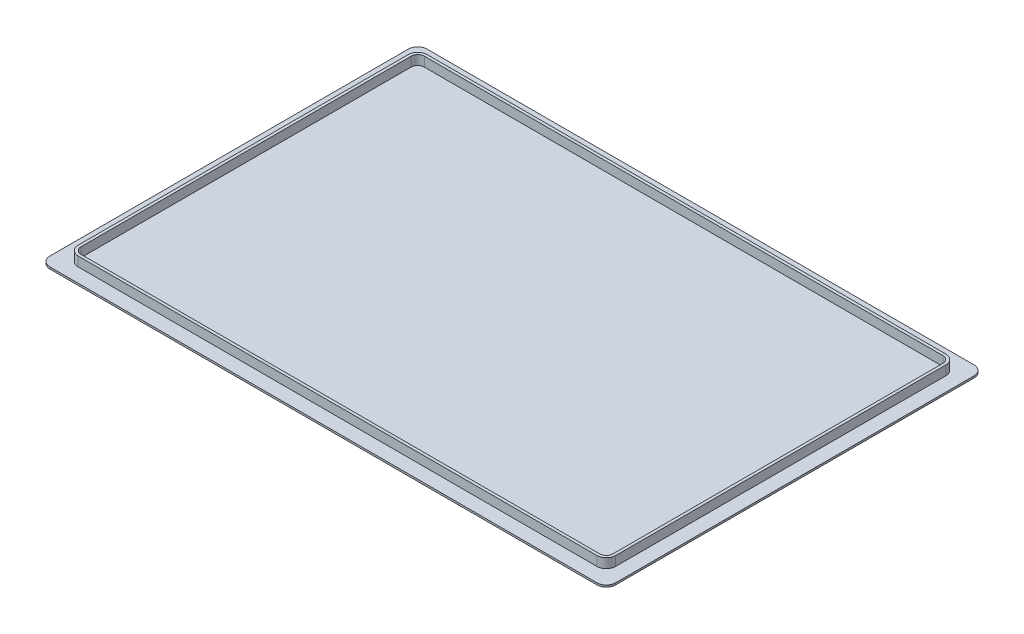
ISO-10303-21;
HEADER;
FILE_DESCRIPTION(('STEP AP214'),'2;1');
FILE_NAME('part.step','',(''),(''),'','','');
FILE_SCHEMA(('AUTOMOTIVE_DESIGN { 1 0 10303 214 1 1 1 1 }'));
ENDSEC;
DATA;
#1=APPLICATION_CONTEXT('core data for automotive mechanical design processes');
#2=APPLICATION_PROTOCOL_DEFINITION('international standard','automotive_design',2000,#1);
#3=PRODUCT_CONTEXT('',#1,'mechanical');
#4=PRODUCT('Part','Part','',(#3));
#5=PRODUCT_RELATED_PRODUCT_CATEGORY('part','',(#4));
#6=PRODUCT_DEFINITION_FORMATION('','',#4);
#7=PRODUCT_DEFINITION_CONTEXT('part definition',#1,'design');
#8=PRODUCT_DEFINITION('design','',#6,#7);
#9=PRODUCT_DEFINITION_SHAPE('','',#8);
#10=(LENGTH_UNIT() NAMED_UNIT(*) SI_UNIT(.MILLI.,.METRE.));
#11=(NAMED_UNIT(*) PLANE_ANGLE_UNIT() SI_UNIT($,.RADIAN.));
#12=(NAMED_UNIT(*) SI_UNIT($,.STERADIAN.) SOLID_ANGLE_UNIT());
#13=UNCERTAINTY_MEASURE_WITH_UNIT(LENGTH_MEASURE(1.E-05),#10,'distance_accuracy_value','');
#14=(GEOMETRIC_REPRESENTATION_CONTEXT(3) GLOBAL_UNCERTAINTY_ASSIGNED_CONTEXT((#13)) GLOBAL_UNIT_ASSIGNED_CONTEXT((#10,
#11,#12)) REPRESENTATION_CONTEXT('',''));
#15=CARTESIAN_POINT('',(0.,0.,0.));
#16=DIRECTION('',(0.,0.,1.));
#17=DIRECTION('',(1.,0.,0.));
#18=AXIS2_PLACEMENT_3D('',#15,#16,#17);
#19=CARTESIAN_POINT('',(290.,2.,190.));
#20=DIRECTION('',(0.,-1.,0.));
#21=DIRECTION('',(0.,0.,-1.));
#22=AXIS2_PLACEMENT_3D('',#19,#20,#21);
#23=PLANE('',#22);
#24=CARTESIAN_POINT('',(290.,2.,190.));
#25=DIRECTION('',(0.,1.,0.));
#26=DIRECTION('',(0.,0.,-1.));
#27=AXIS2_PLACEMENT_3D('',#24,#25,#26);
#28=CIRCLE('',#27,10.);
#29=CARTESIAN_POINT('',(290.,2.,200.));
#30=VERTEX_POINT('',#29);
#31=CARTESIAN_POINT('',(300.,2.,190.));
#32=VERTEX_POINT('',#31);
#33=EDGE_CURVE('E374',#30,#32,#28,.T.);
#34=ORIENTED_EDGE('',*,*,#33,.T.);
#35=DIRECTION('',(0.,0.,-1.));
#36=VECTOR('',#35,1.);
#37=CARTESIAN_POINT('',(300.,2.,190.));
#38=LINE('',#37,#36);
#39=CARTESIAN_POINT('',(300.,2.,-190.));
#40=VERTEX_POINT('',#39);
#41=EDGE_CURVE('E377',#32,#40,#38,.T.);
#42=ORIENTED_EDGE('',*,*,#41,.T.);
#43=CARTESIAN_POINT('',(290.,2.,-190.));
#44=DIRECTION('',(0.,1.,0.));
#45=DIRECTION('',(0.,0.,1.));
#46=AXIS2_PLACEMENT_3D('',#43,#44,#45);
#47=CIRCLE('',#46,10.);
#48=CARTESIAN_POINT('',(290.,2.,-200.));
#49=VERTEX_POINT('',#48);
#50=EDGE_CURVE('E380',#40,#49,#47,.T.);
#51=ORIENTED_EDGE('',*,*,#50,.T.);
#52=DIRECTION('',(-1.,0.,0.));
#53=VECTOR('',#52,1.);
#54=CARTESIAN_POINT('',(-290.,2.,-200.));
#55=LINE('',#54,#53);
#56=CARTESIAN_POINT('',(-290.,2.,-200.));
#57=VERTEX_POINT('',#56);
#58=EDGE_CURVE('E382',#49,#57,#55,.T.);
#59=ORIENTED_EDGE('',*,*,#58,.T.);
#60=CARTESIAN_POINT('',(-290.,2.,-190.));
#61=DIRECTION('',(0.,1.,0.));
#62=DIRECTION('',(0.,0.,1.));
#63=AXIS2_PLACEMENT_3D('',#60,#61,#62);
#64=CIRCLE('',#63,10.);
#65=CARTESIAN_POINT('',(-300.,2.,-190.));
#66=VERTEX_POINT('',#65);
#67=EDGE_CURVE('E384',#57,#66,#64,.T.);
#68=ORIENTED_EDGE('',*,*,#67,.T.);
#69=DIRECTION('',(0.,0.,1.));
#70=VECTOR('',#69,1.);
#71=CARTESIAN_POINT('',(-300.,2.,190.));
#72=LINE('',#71,#70);
#73=CARTESIAN_POINT('',(-300.,2.,190.));
#74=VERTEX_POINT('',#73);
#75=EDGE_CURVE('E386',#66,#74,#72,.T.);
#76=ORIENTED_EDGE('',*,*,#75,.T.);
#77=CARTESIAN_POINT('',(-290.,2.,190.));
#78=DIRECTION('',(0.,1.,0.));
#79=DIRECTION('',(0.,0.,1.));
#80=AXIS2_PLACEMENT_3D('',#77,#78,#79);
#81=CIRCLE('',#80,10.);
#82=CARTESIAN_POINT('',(-290.,2.,200.));
#83=VERTEX_POINT('',#82);
#84=EDGE_CURVE('E388',#74,#83,#81,.T.);
#85=ORIENTED_EDGE('',*,*,#84,.T.);
#86=DIRECTION('',(1.,0.,0.));
#87=VECTOR('',#86,1.);
#88=CARTESIAN_POINT('',(-290.,2.,200.));
#89=LINE('',#88,#87);
#90=EDGE_CURVE('E390',#83,#30,#89,.T.);
#91=ORIENTED_EDGE('',*,*,#90,.T.);
#92=EDGE_LOOP('',(#34,#42,#51,#59,#68,#76,#85,#91));
#93=FACE_BOUND('',#92,.T.);
#94=CARTESIAN_POINT('',(275.,2.,-175.));
#95=DIRECTION('',(0.,1.,0.));
#96=DIRECTION('',(0.,0.,-1.));
#97=AXIS2_PLACEMENT_3D('',#94,#95,#96);
#98=CIRCLE('',#97,10.);
#99=CARTESIAN_POINT('',(285.,2.,-175.));
#100=VERTEX_POINT('',#99);
#101=CARTESIAN_POINT('',(275.,2.,-185.));
#102=VERTEX_POINT('',#101);
#103=EDGE_CURVE('E261',#100,#102,#98,.T.);
#104=ORIENTED_EDGE('',*,*,#103,.F.);
#105=DIRECTION('',(0.,0.,-1.));
#106=VECTOR('',#105,1.);
#107=CARTESIAN_POINT('',(285.,2.,175.));
#108=LINE('',#107,#106);
#109=CARTESIAN_POINT('',(285.,2.,175.));
#110=VERTEX_POINT('',#109);
#111=EDGE_CURVE('E318',#110,#100,#108,.T.);
#112=ORIENTED_EDGE('',*,*,#111,.F.);
#113=CARTESIAN_POINT('',(275.,2.,175.));
#114=DIRECTION('',(0.,1.,0.));
#115=DIRECTION('',(0.,0.,-1.));
#116=AXIS2_PLACEMENT_3D('',#113,#114,#115);
#117=CIRCLE('',#116,10.);
#118=CARTESIAN_POINT('',(275.,2.,185.));
#119=VERTEX_POINT('',#118);
#120=EDGE_CURVE('E346',#119,#110,#117,.T.);
#121=ORIENTED_EDGE('',*,*,#120,.F.);
#122=DIRECTION('',(1.,0.,0.));
#123=VECTOR('',#122,1.);
#124=CARTESIAN_POINT('',(-275.,2.,185.));
#125=LINE('',#124,#123);
#126=CARTESIAN_POINT('',(-275.,2.,185.));
#127=VERTEX_POINT('',#126);
#128=EDGE_CURVE('E343',#127,#119,#125,.T.);
#129=ORIENTED_EDGE('',*,*,#128,.F.);
#130=CARTESIAN_POINT('',(-275.,2.,175.));
#131=DIRECTION('',(0.,1.,0.));
#132=DIRECTION('',(0.,0.,-1.));
#133=AXIS2_PLACEMENT_3D('',#130,#131,#132);
#134=CIRCLE('',#133,10.);
#135=CARTESIAN_POINT('',(-285.,2.,175.));
#136=VERTEX_POINT('',#135);
#137=EDGE_CURVE('E340',#136,#127,#134,.T.);
#138=ORIENTED_EDGE('',*,*,#137,.F.);
#139=DIRECTION('',(0.,0.,1.));
#140=VECTOR('',#139,1.);
#141=CARTESIAN_POINT('',(-285.,2.,-175.));
#142=LINE('',#141,#140);
#143=CARTESIAN_POINT('',(-285.,2.,-175.));
#144=VERTEX_POINT('',#143);
#145=EDGE_CURVE('E337',#144,#136,#142,.T.);
#146=ORIENTED_EDGE('',*,*,#145,.F.);
#147=CARTESIAN_POINT('',(-275.,2.,-175.));
#148=DIRECTION('',(0.,1.,0.));
#149=DIRECTION('',(0.,0.,1.));
#150=AXIS2_PLACEMENT_3D('',#147,#148,#149);
#151=CIRCLE('',#150,10.);
#152=CARTESIAN_POINT('',(-275.,2.,-185.));
#153=VERTEX_POINT('',#152);
#154=EDGE_CURVE('E103',#153,#144,#151,.T.);
#155=ORIENTED_EDGE('',*,*,#154,.F.);
#156=DIRECTION('',(-1.,0.,0.));
#157=VECTOR('',#156,1.);
#158=CARTESIAN_POINT('',(275.,2.,-185.));
#159=LINE('',#158,#157);
#160=EDGE_CURVE('E98',#102,#153,#159,.T.);
#161=ORIENTED_EDGE('',*,*,#160,.F.);
#162=EDGE_LOOP('',(#104,#112,#121,#129,#138,#146,#155,#161));
#163=FACE_BOUND('',#162,.T.);
#164=ADVANCED_FACE('F83',(#93,#163),#23,.F.);
#165=CARTESIAN_POINT('',(290.,2.,190.));
#166=DIRECTION('',(0.,-1.,0.));
#167=DIRECTION('',(0.,0.,-1.));
#168=AXIS2_PLACEMENT_3D('',#165,#166,#167);
#169=CYLINDRICAL_SURFACE('',#168,10.);
#170=CARTESIAN_POINT('',(290.,0.,190.));
#171=DIRECTION('',(0.,1.,0.));
#172=DIRECTION('',(0.,0.,-1.));
#173=AXIS2_PLACEMENT_3D('',#170,#171,#172);
#174=CIRCLE('',#173,10.);
#175=CARTESIAN_POINT('',(290.,0.,200.));
#176=VERTEX_POINT('',#175);
#177=CARTESIAN_POINT('',(300.,0.,190.));
#178=VERTEX_POINT('',#177);
#179=EDGE_CURVE('E373',#176,#178,#174,.T.);
#180=ORIENTED_EDGE('',*,*,#179,.T.);
#181=DIRECTION('',(0.,-1.,0.));
#182=VECTOR('',#181,1.);
#183=CARTESIAN_POINT('',(300.,2.,190.));
#184=LINE('',#183,#182);
#185=EDGE_CURVE('E12',#32,#178,#184,.T.);
#186=ORIENTED_EDGE('',*,*,#185,.F.);
#187=ORIENTED_EDGE('',*,*,#33,.F.);
#188=DIRECTION('',(0.,-1.,0.));
#189=VECTOR('',#188,1.);
#190=CARTESIAN_POINT('',(290.,2.,200.));
#191=LINE('',#190,#189);
#192=EDGE_CURVE('E392',#30,#176,#191,.T.);
#193=ORIENTED_EDGE('',*,*,#192,.T.);
#194=EDGE_LOOP('',(#180,#186,#187,#193));
#195=FACE_BOUND('',#194,.T.);
#196=ADVANCED_FACE('F85',(#195),#169,.T.);
#197=CARTESIAN_POINT('',(300.,2.,190.));
#198=DIRECTION('',(-1.,0.,0.));
#199=DIRECTION('',(0.,0.,1.));
#200=AXIS2_PLACEMENT_3D('',#197,#198,#199);
#201=PLANE('',#200);
#202=DIRECTION('',(0.,0.,-1.));
#203=VECTOR('',#202,1.);
#204=CARTESIAN_POINT('',(300.,0.,190.));
#205=LINE('',#204,#203);
#206=CARTESIAN_POINT('',(300.,0.,-190.));
#207=VERTEX_POINT('',#206);
#208=EDGE_CURVE('E395',#178,#207,#205,.T.);
#209=ORIENTED_EDGE('',*,*,#208,.T.);
#210=DIRECTION('',(0.,-1.,0.));
#211=VECTOR('',#210,1.);
#212=CARTESIAN_POINT('',(300.,2.,-190.));
#213=LINE('',#212,#211);
#214=EDGE_CURVE('E91',#40,#207,#213,.T.);
#215=ORIENTED_EDGE('',*,*,#214,.F.);
#216=ORIENTED_EDGE('',*,*,#41,.F.);
#217=ORIENTED_EDGE('',*,*,#185,.T.);
#218=EDGE_LOOP('',(#209,#215,#216,#217));
#219=FACE_BOUND('',#218,.T.);
#220=ADVANCED_FACE('F451',(#219),#201,.F.);
#221=CARTESIAN_POINT('',(290.,2.,-190.));
#222=DIRECTION('',(0.,-1.,0.));
#223=DIRECTION('',(0.,0.,-1.));
#224=AXIS2_PLACEMENT_3D('',#221,#222,#223);
#225=CYLINDRICAL_SURFACE('',#224,10.);
#226=CARTESIAN_POINT('',(290.,0.,-190.));
#227=DIRECTION('',(0.,1.,0.));
#228=DIRECTION('',(0.,0.,1.));
#229=AXIS2_PLACEMENT_3D('',#226,#227,#228);
#230=CIRCLE('',#229,10.);
#231=CARTESIAN_POINT('',(290.,0.,-200.));
#232=VERTEX_POINT('',#231);
#233=EDGE_CURVE('E397',#207,#232,#230,.T.);
#234=ORIENTED_EDGE('',*,*,#233,.T.);
#235=DIRECTION('',(0.,-1.,0.));
#236=VECTOR('',#235,1.);
#237=CARTESIAN_POINT('',(290.,2.,-200.));
#238=LINE('',#237,#236);
#239=EDGE_CURVE('E422',#49,#232,#238,.T.);
#240=ORIENTED_EDGE('',*,*,#239,.F.);
#241=ORIENTED_EDGE('',*,*,#50,.F.);
#242=ORIENTED_EDGE('',*,*,#214,.T.);
#243=EDGE_LOOP('',(#234,#240,#241,#242));
#244=FACE_BOUND('',#243,.T.);
#245=ADVANCED_FACE('F429',(#244),#225,.T.);
#246=CARTESIAN_POINT('',(-290.,2.,-200.));
#247=DIRECTION('',(0.,0.,1.));
#248=DIRECTION('',(1.,0.,0.));
#249=AXIS2_PLACEMENT_3D('',#246,#247,#248);
#250=PLANE('',#249);
#251=DIRECTION('',(-1.,0.,0.));
#252=VECTOR('',#251,1.);
#253=CARTESIAN_POINT('',(-290.,0.,-200.));
#254=LINE('',#253,#252);
#255=CARTESIAN_POINT('',(-290.,0.,-200.));
#256=VERTEX_POINT('',#255);
#257=EDGE_CURVE('E399',#232,#256,#254,.T.);
#258=ORIENTED_EDGE('',*,*,#257,.T.);
#259=DIRECTION('',(0.,-1.,0.));
#260=VECTOR('',#259,1.);
#261=CARTESIAN_POINT('',(-290.,2.,-200.));
#262=LINE('',#261,#260);
#263=EDGE_CURVE('E419',#57,#256,#262,.T.);
#264=ORIENTED_EDGE('',*,*,#263,.F.);
#265=ORIENTED_EDGE('',*,*,#58,.F.);
#266=ORIENTED_EDGE('',*,*,#239,.T.);
#267=EDGE_LOOP('',(#258,#264,#265,#266));
#268=FACE_BOUND('',#267,.T.);
#269=ADVANCED_FACE('F440',(#268),#250,.F.);
#270=CARTESIAN_POINT('',(-290.,2.,-190.));
#271=DIRECTION('',(0.,-1.,0.));
#272=DIRECTION('',(0.,0.,-1.));
#273=AXIS2_PLACEMENT_3D('',#270,#271,#272);
#274=CYLINDRICAL_SURFACE('',#273,10.);
#275=CARTESIAN_POINT('',(-290.,0.,-190.));
#276=DIRECTION('',(0.,1.,0.));
#277=DIRECTION('',(0.,0.,1.));
#278=AXIS2_PLACEMENT_3D('',#275,#276,#277);
#279=CIRCLE('',#278,10.);
#280=CARTESIAN_POINT('',(-300.,0.,-190.));
#281=VERTEX_POINT('',#280);
#282=EDGE_CURVE('E401',#256,#281,#279,.T.);
#283=ORIENTED_EDGE('',*,*,#282,.T.);
#284=DIRECTION('',(0.,-1.,0.));
#285=VECTOR('',#284,1.);
#286=CARTESIAN_POINT('',(-300.,2.,-190.));
#287=LINE('',#286,#285);
#288=EDGE_CURVE('E416',#66,#281,#287,.T.);
#289=ORIENTED_EDGE('',*,*,#288,.F.);
#290=ORIENTED_EDGE('',*,*,#67,.F.);
#291=ORIENTED_EDGE('',*,*,#263,.T.);
#292=EDGE_LOOP('',(#283,#289,#290,#291));
#293=FACE_BOUND('',#292,.T.);
#294=ADVANCED_FACE('F444',(#293),#274,.T.);
#295=CARTESIAN_POINT('',(-300.,2.,190.));
#296=DIRECTION('',(1.,0.,0.));
#297=DIRECTION('',(0.,0.,-1.));
#298=AXIS2_PLACEMENT_3D('',#295,#296,#297);
#299=PLANE('',#298);
#300=DIRECTION('',(0.,0.,1.));
#301=VECTOR('',#300,1.);
#302=CARTESIAN_POINT('',(-300.,0.,190.));
#303=LINE('',#302,#301);
#304=CARTESIAN_POINT('',(-300.,0.,190.));
#305=VERTEX_POINT('',#304);
#306=EDGE_CURVE('E403',#281,#305,#303,.T.);
#307=ORIENTED_EDGE('',*,*,#306,.T.);
#308=DIRECTION('',(0.,-1.,0.));
#309=VECTOR('',#308,1.);
#310=CARTESIAN_POINT('',(-300.,2.,190.));
#311=LINE('',#310,#309);
#312=EDGE_CURVE('E413',#74,#305,#311,.T.);
#313=ORIENTED_EDGE('',*,*,#312,.F.);
#314=ORIENTED_EDGE('',*,*,#75,.F.);
#315=ORIENTED_EDGE('',*,*,#288,.T.);
#316=EDGE_LOOP('',(#307,#313,#314,#315));
#317=FACE_BOUND('',#316,.T.);
#318=ADVANCED_FACE('F464',(#317),#299,.F.);
#319=CARTESIAN_POINT('',(-290.,2.,190.));
#320=DIRECTION('',(0.,-1.,0.));
#321=DIRECTION('',(0.,0.,-1.));
#322=AXIS2_PLACEMENT_3D('',#319,#320,#321);
#323=CYLINDRICAL_SURFACE('',#322,10.);
#324=CARTESIAN_POINT('',(-290.,0.,190.));
#325=DIRECTION('',(0.,1.,0.));
#326=DIRECTION('',(0.,0.,1.));
#327=AXIS2_PLACEMENT_3D('',#324,#325,#326);
#328=CIRCLE('',#327,10.);
#329=CARTESIAN_POINT('',(-290.,0.,200.));
#330=VERTEX_POINT('',#329);
#331=EDGE_CURVE('E405',#305,#330,#328,.T.);
#332=ORIENTED_EDGE('',*,*,#331,.T.);
#333=DIRECTION('',(0.,-1.,0.));
#334=VECTOR('',#333,1.);
#335=CARTESIAN_POINT('',(-290.,2.,200.));
#336=LINE('',#335,#334);
#337=EDGE_CURVE('E410',#83,#330,#336,.T.);
#338=ORIENTED_EDGE('',*,*,#337,.F.);
#339=ORIENTED_EDGE('',*,*,#84,.F.);
#340=ORIENTED_EDGE('',*,*,#312,.T.);
#341=EDGE_LOOP('',(#332,#338,#339,#340));
#342=FACE_BOUND('',#341,.T.);
#343=ADVANCED_FACE('F462',(#342),#323,.T.);
#344=CARTESIAN_POINT('',(-290.,2.,200.));
#345=DIRECTION('',(0.,0.,-1.));
#346=DIRECTION('',(-1.,0.,0.));
#347=AXIS2_PLACEMENT_3D('',#344,#345,#346);
#348=PLANE('',#347);
#349=DIRECTION('',(1.,0.,0.));
#350=VECTOR('',#349,1.);
#351=CARTESIAN_POINT('',(-290.,0.,200.));
#352=LINE('',#351,#350);
#353=EDGE_CURVE('E378',#330,#176,#352,.T.);
#354=ORIENTED_EDGE('',*,*,#353,.T.);
#355=ORIENTED_EDGE('',*,*,#192,.F.);
#356=ORIENTED_EDGE('',*,*,#90,.F.);
#357=ORIENTED_EDGE('',*,*,#337,.T.);
#358=EDGE_LOOP('',(#354,#355,#356,#357));
#359=FACE_BOUND('',#358,.T.);
#360=ADVANCED_FACE('F457',(#359),#348,.F.);
#361=CARTESIAN_POINT('',(290.,0.,190.));
#362=DIRECTION('',(0.,-1.,0.));
#363=DIRECTION('',(0.,0.,-1.));
#364=AXIS2_PLACEMENT_3D('',#361,#362,#363);
#365=PLANE('',#364);
#366=ORIENTED_EDGE('',*,*,#179,.F.);
#367=ORIENTED_EDGE('',*,*,#353,.F.);
#368=ORIENTED_EDGE('',*,*,#331,.F.);
#369=ORIENTED_EDGE('',*,*,#306,.F.);
#370=ORIENTED_EDGE('',*,*,#282,.F.);
#371=ORIENTED_EDGE('',*,*,#257,.F.);
#372=ORIENTED_EDGE('',*,*,#233,.F.);
#373=ORIENTED_EDGE('',*,*,#208,.F.);
#374=EDGE_LOOP('',(#366,#367,#368,#369,#370,#371,#372,#373));
#375=FACE_BOUND('',#374,.T.);
#376=ADVANCED_FACE('F435',(#375),#365,.T.);
#377=CARTESIAN_POINT('',(275.,12.,-175.));
#378=DIRECTION('',(0.,1.,0.));
#379=DIRECTION('',(0.,0.,1.));
#380=AXIS2_PLACEMENT_3D('',#377,#378,#379);
#381=PLANE('',#380);
#382=CARTESIAN_POINT('',(275.,12.,-175.));
#383=DIRECTION('',(0.,1.,0.));
#384=DIRECTION('',(0.,0.,-1.));
#385=AXIS2_PLACEMENT_3D('',#382,#383,#384);
#386=CIRCLE('',#385,10.);
#387=CARTESIAN_POINT('',(285.,12.,-175.));
#388=VERTEX_POINT('',#387);
#389=CARTESIAN_POINT('',(275.,12.,-185.));
#390=VERTEX_POINT('',#389);
#391=EDGE_CURVE('E314',#388,#390,#386,.T.);
#392=ORIENTED_EDGE('',*,*,#391,.T.);
#393=DIRECTION('',(-1.,0.,0.));
#394=VECTOR('',#393,1.);
#395=CARTESIAN_POINT('',(275.,12.,-185.));
#396=LINE('',#395,#394);
#397=CARTESIAN_POINT('',(-275.,12.,-185.));
#398=VERTEX_POINT('',#397);
#399=EDGE_CURVE('E317',#390,#398,#396,.T.);
#400=ORIENTED_EDGE('',*,*,#399,.T.);
#401=CARTESIAN_POINT('',(-275.,12.,-175.));
#402=DIRECTION('',(0.,1.,0.));
#403=DIRECTION('',(0.,0.,1.));
#404=AXIS2_PLACEMENT_3D('',#401,#402,#403);
#405=CIRCLE('',#404,10.);
#406=CARTESIAN_POINT('',(-285.,12.,-175.));
#407=VERTEX_POINT('',#406);
#408=EDGE_CURVE('E320',#398,#407,#405,.T.);
#409=ORIENTED_EDGE('',*,*,#408,.T.);
#410=DIRECTION('',(0.,0.,1.));
#411=VECTOR('',#410,1.);
#412=CARTESIAN_POINT('',(-285.,12.,-175.));
#413=LINE('',#412,#411);
#414=CARTESIAN_POINT('',(-285.,12.,175.));
#415=VERTEX_POINT('',#414);
#416=EDGE_CURVE('E322',#407,#415,#413,.T.);
#417=ORIENTED_EDGE('',*,*,#416,.T.);
#418=CARTESIAN_POINT('',(-275.,12.,175.));
#419=DIRECTION('',(0.,1.,0.));
#420=DIRECTION('',(0.,0.,-1.));
#421=AXIS2_PLACEMENT_3D('',#418,#419,#420);
#422=CIRCLE('',#421,10.);
#423=CARTESIAN_POINT('',(-275.,12.,185.));
#424=VERTEX_POINT('',#423);
#425=EDGE_CURVE('E324',#415,#424,#422,.T.);
#426=ORIENTED_EDGE('',*,*,#425,.T.);
#427=DIRECTION('',(1.,0.,0.));
#428=VECTOR('',#427,1.);
#429=CARTESIAN_POINT('',(-275.,12.,185.));
#430=LINE('',#429,#428);
#431=CARTESIAN_POINT('',(275.,12.,185.));
#432=VERTEX_POINT('',#431);
#433=EDGE_CURVE('E326',#424,#432,#430,.T.);
#434=ORIENTED_EDGE('',*,*,#433,.T.);
#435=CARTESIAN_POINT('',(275.,12.,175.));
#436=DIRECTION('',(0.,1.,0.));
#437=DIRECTION('',(0.,0.,-1.));
#438=AXIS2_PLACEMENT_3D('',#435,#436,#437);
#439=CIRCLE('',#438,10.);
#440=CARTESIAN_POINT('',(285.,12.,175.));
#441=VERTEX_POINT('',#440);
#442=EDGE_CURVE('E328',#432,#441,#439,.T.);
#443=ORIENTED_EDGE('',*,*,#442,.T.);
#444=DIRECTION('',(0.,0.,-1.));
#445=VECTOR('',#444,1.);
#446=CARTESIAN_POINT('',(285.,12.,175.));
#447=LINE('',#446,#445);
#448=EDGE_CURVE('E330',#441,#388,#447,.T.);
#449=ORIENTED_EDGE('',*,*,#448,.T.);
#450=EDGE_LOOP('',(#392,#400,#409,#417,#426,#434,#443,#449));
#451=FACE_BOUND('',#450,.T.);
#452=DIRECTION('',(-1.,0.,0.));
#453=VECTOR('',#452,1.);
#454=CARTESIAN_POINT('',(275.,12.,-182.));
#455=LINE('',#454,#453);
#456=CARTESIAN_POINT('',(275.,12.,-182.));
#457=VERTEX_POINT('',#456);
#458=CARTESIAN_POINT('',(-275.,12.,-182.));
#459=VERTEX_POINT('',#458);
#460=EDGE_CURVE('E253',#457,#459,#455,.T.);
#461=ORIENTED_EDGE('',*,*,#460,.F.);
#462=CARTESIAN_POINT('',(275.,12.,-175.));
#463=DIRECTION('',(0.,-1.,0.));
#464=DIRECTION('',(-1.,0.,0.));
#465=AXIS2_PLACEMENT_3D('',#462,#463,#464);
#466=CIRCLE('',#465,7.00000000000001);
#467=CARTESIAN_POINT('',(282.,12.,-175.));
#468=VERTEX_POINT('',#467);
#469=EDGE_CURVE('E243',#468,#457,#466,.F.);
#470=ORIENTED_EDGE('',*,*,#469,.F.);
#471=DIRECTION('',(0.,0.,-1.));
#472=VECTOR('',#471,1.);
#473=CARTESIAN_POINT('',(282.,12.,-175.));
#474=LINE('',#473,#472);
#475=CARTESIAN_POINT('',(282.,12.,175.));
#476=VERTEX_POINT('',#475);
#477=EDGE_CURVE('E280',#476,#468,#474,.T.);
#478=ORIENTED_EDGE('',*,*,#477,.F.);
#479=CARTESIAN_POINT('',(275.,12.,175.));
#480=DIRECTION('',(0.,-1.,0.));
#481=DIRECTION('',(-1.,0.,0.));
#482=AXIS2_PLACEMENT_3D('',#479,#480,#481);
#483=CIRCLE('',#482,7.00000000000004);
#484=CARTESIAN_POINT('',(275.,12.,182.));
#485=VERTEX_POINT('',#484);
#486=EDGE_CURVE('E277',#485,#476,#483,.F.);
#487=ORIENTED_EDGE('',*,*,#486,.F.);
#488=DIRECTION('',(1.,0.,0.));
#489=VECTOR('',#488,1.);
#490=CARTESIAN_POINT('',(275.,12.,182.));
#491=LINE('',#490,#489);
#492=CARTESIAN_POINT('',(-275.,12.,182.));
#493=VERTEX_POINT('',#492);
#494=EDGE_CURVE('E275',#493,#485,#491,.T.);
#495=ORIENTED_EDGE('',*,*,#494,.F.);
#496=CARTESIAN_POINT('',(-275.,12.,175.));
#497=DIRECTION('',(0.,-1.,0.));
#498=DIRECTION('',(-1.,0.,0.));
#499=AXIS2_PLACEMENT_3D('',#496,#497,#498);
#500=CIRCLE('',#499,7.00000000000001);
#501=CARTESIAN_POINT('',(-282.,12.,175.));
#502=VERTEX_POINT('',#501);
#503=EDGE_CURVE('E273',#502,#493,#500,.F.);
#504=ORIENTED_EDGE('',*,*,#503,.F.);
#505=DIRECTION('',(0.,0.,1.));
#506=VECTOR('',#505,1.);
#507=CARTESIAN_POINT('',(-282.,12.,-175.));
#508=LINE('',#507,#506);
#509=CARTESIAN_POINT('',(-282.,12.,-175.));
#510=VERTEX_POINT('',#509);
#511=EDGE_CURVE('E269',#510,#502,#508,.T.);
#512=ORIENTED_EDGE('',*,*,#511,.F.);
#513=CARTESIAN_POINT('',(-275.,12.,-175.));
#514=DIRECTION('',(0.,-1.,0.));
#515=DIRECTION('',(-1.,0.,0.));
#516=AXIS2_PLACEMENT_3D('',#513,#514,#515);
#517=CIRCLE('',#516,7.00000000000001);
#518=EDGE_CURVE('E267',#459,#510,#517,.F.);
#519=ORIENTED_EDGE('',*,*,#518,.F.);
#520=EDGE_LOOP('',(#461,#470,#478,#487,#495,#504,#512,#519));
#521=FACE_BOUND('',#520,.T.);
#522=ADVANCED_FACE('F265',(#451,#521),#381,.T.);
#523=CARTESIAN_POINT('',(275.,12.,-175.));
#524=DIRECTION('',(0.,-1.,0.));
#525=DIRECTION('',(0.,0.,-1.));
#526=AXIS2_PLACEMENT_3D('',#523,#524,#525);
#527=CYLINDRICAL_SURFACE('',#526,10.);
#528=ORIENTED_EDGE('',*,*,#103,.T.);
#529=DIRECTION('',(0.,-1.,0.));
#530=VECTOR('',#529,1.);
#531=CARTESIAN_POINT('',(275.,12.,-185.));
#532=LINE('',#531,#530);
#533=EDGE_CURVE('E371',#390,#102,#532,.T.);
#534=ORIENTED_EDGE('',*,*,#533,.F.);
#535=ORIENTED_EDGE('',*,*,#391,.F.);
#536=DIRECTION('',(0.,-1.,0.));
#537=VECTOR('',#536,1.);
#538=CARTESIAN_POINT('',(285.,12.,-175.));
#539=LINE('',#538,#537);
#540=EDGE_CURVE('E332',#388,#100,#539,.T.);
#541=ORIENTED_EDGE('',*,*,#540,.T.);
#542=EDGE_LOOP('',(#528,#534,#535,#541));
#543=FACE_BOUND('',#542,.T.);
#544=ADVANCED_FACE('F527',(#543),#527,.T.);
#545=CARTESIAN_POINT('',(275.,12.,-185.));
#546=DIRECTION('',(0.,0.,1.));
#547=DIRECTION('',(1.,0.,0.));
#548=AXIS2_PLACEMENT_3D('',#545,#546,#547);
#549=PLANE('',#548);
#550=ORIENTED_EDGE('',*,*,#160,.T.);
#551=DIRECTION('',(0.,-1.,0.));
#552=VECTOR('',#551,1.);
#553=CARTESIAN_POINT('',(-275.,12.,-185.));
#554=LINE('',#553,#552);
#555=EDGE_CURVE('E368',#398,#153,#554,.T.);
#556=ORIENTED_EDGE('',*,*,#555,.F.);
#557=ORIENTED_EDGE('',*,*,#399,.F.);
#558=ORIENTED_EDGE('',*,*,#533,.T.);
#559=EDGE_LOOP('',(#550,#556,#557,#558));
#560=FACE_BOUND('',#559,.T.);
#561=ADVANCED_FACE('F551',(#560),#549,.F.);
#562=CARTESIAN_POINT('',(-275.,12.,-175.));
#563=DIRECTION('',(0.,-1.,0.));
#564=DIRECTION('',(0.,0.,-1.));
#565=AXIS2_PLACEMENT_3D('',#562,#563,#564);
#566=CYLINDRICAL_SURFACE('',#565,10.);
#567=ORIENTED_EDGE('',*,*,#154,.T.);
#568=DIRECTION('',(0.,-1.,0.));
#569=VECTOR('',#568,1.);
#570=CARTESIAN_POINT('',(-285.,12.,-175.));
#571=LINE('',#570,#569);
#572=EDGE_CURVE('E365',#407,#144,#571,.T.);
#573=ORIENTED_EDGE('',*,*,#572,.F.);
#574=ORIENTED_EDGE('',*,*,#408,.F.);
#575=ORIENTED_EDGE('',*,*,#555,.T.);
#576=EDGE_LOOP('',(#567,#573,#574,#575));
#577=FACE_BOUND('',#576,.T.);
#578=ADVANCED_FACE('F547',(#577),#566,.T.);
#579=CARTESIAN_POINT('',(-285.,12.,-175.));
#580=DIRECTION('',(1.,0.,0.));
#581=DIRECTION('',(0.,0.,-1.));
#582=AXIS2_PLACEMENT_3D('',#579,#580,#581);
#583=PLANE('',#582);
#584=ORIENTED_EDGE('',*,*,#145,.T.);
#585=DIRECTION('',(0.,-1.,0.));
#586=VECTOR('',#585,1.);
#587=CARTESIAN_POINT('',(-285.,12.,175.));
#588=LINE('',#587,#586);
#589=EDGE_CURVE('E362',#415,#136,#588,.T.);
#590=ORIENTED_EDGE('',*,*,#589,.F.);
#591=ORIENTED_EDGE('',*,*,#416,.F.);
#592=ORIENTED_EDGE('',*,*,#572,.T.);
#593=EDGE_LOOP('',(#584,#590,#591,#592));
#594=FACE_BOUND('',#593,.T.);
#595=ADVANCED_FACE('F543',(#594),#583,.F.);
#596=CARTESIAN_POINT('',(-275.,12.,175.));
#597=DIRECTION('',(0.,-1.,0.));
#598=DIRECTION('',(0.,0.,-1.));
#599=AXIS2_PLACEMENT_3D('',#596,#597,#598);
#600=CYLINDRICAL_SURFACE('',#599,10.);
#601=ORIENTED_EDGE('',*,*,#137,.T.);
#602=DIRECTION('',(0.,-1.,0.));
#603=VECTOR('',#602,1.);
#604=CARTESIAN_POINT('',(-275.,12.,185.));
#605=LINE('',#604,#603);
#606=EDGE_CURVE('E359',#424,#127,#605,.T.);
#607=ORIENTED_EDGE('',*,*,#606,.F.);
#608=ORIENTED_EDGE('',*,*,#425,.F.);
#609=ORIENTED_EDGE('',*,*,#589,.T.);
#610=EDGE_LOOP('',(#601,#607,#608,#609));
#611=FACE_BOUND('',#610,.T.);
#612=ADVANCED_FACE('F539',(#611),#600,.T.);
#613=CARTESIAN_POINT('',(-275.,12.,185.));
#614=DIRECTION('',(0.,0.,-1.));
#615=DIRECTION('',(-1.,0.,0.));
#616=AXIS2_PLACEMENT_3D('',#613,#614,#615);
#617=PLANE('',#616);
#618=ORIENTED_EDGE('',*,*,#128,.T.);
#619=DIRECTION('',(0.,-1.,0.));
#620=VECTOR('',#619,1.);
#621=CARTESIAN_POINT('',(275.,12.,185.));
#622=LINE('',#621,#620);
#623=EDGE_CURVE('E356',#432,#119,#622,.T.);
#624=ORIENTED_EDGE('',*,*,#623,.F.);
#625=ORIENTED_EDGE('',*,*,#433,.F.);
#626=ORIENTED_EDGE('',*,*,#606,.T.);
#627=EDGE_LOOP('',(#618,#624,#625,#626));
#628=FACE_BOUND('',#627,.T.);
#629=ADVANCED_FACE('F535',(#628),#617,.F.);
#630=CARTESIAN_POINT('',(275.,12.,175.));
#631=DIRECTION('',(0.,-1.,0.));
#632=DIRECTION('',(0.,0.,-1.));
#633=AXIS2_PLACEMENT_3D('',#630,#631,#632);
#634=CYLINDRICAL_SURFACE('',#633,10.);
#635=ORIENTED_EDGE('',*,*,#120,.T.);
#636=DIRECTION('',(0.,-1.,0.));
#637=VECTOR('',#636,1.);
#638=CARTESIAN_POINT('',(285.,12.,175.));
#639=LINE('',#638,#637);
#640=EDGE_CURVE('E353',#441,#110,#639,.T.);
#641=ORIENTED_EDGE('',*,*,#640,.F.);
#642=ORIENTED_EDGE('',*,*,#442,.F.);
#643=ORIENTED_EDGE('',*,*,#623,.T.);
#644=EDGE_LOOP('',(#635,#641,#642,#643));
#645=FACE_BOUND('',#644,.T.);
#646=ADVANCED_FACE('F531',(#645),#634,.T.);
#647=CARTESIAN_POINT('',(285.,12.,175.));
#648=DIRECTION('',(-1.,0.,0.));
#649=DIRECTION('',(0.,0.,1.));
#650=AXIS2_PLACEMENT_3D('',#647,#648,#649);
#651=PLANE('',#650);
#652=ORIENTED_EDGE('',*,*,#111,.T.);
#653=ORIENTED_EDGE('',*,*,#540,.F.);
#654=ORIENTED_EDGE('',*,*,#448,.F.);
#655=ORIENTED_EDGE('',*,*,#640,.T.);
#656=EDGE_LOOP('',(#652,#653,#654,#655));
#657=FACE_BOUND('',#656,.T.);
#658=ADVANCED_FACE('F524',(#657),#651,.F.);
#659=CARTESIAN_POINT('',(275.,12.,-175.));
#660=DIRECTION('',(0.,-1.,0.));
#661=DIRECTION('',(0.,0.,-1.));
#662=AXIS2_PLACEMENT_3D('',#659,#660,#661);
#663=CYLINDRICAL_SURFACE('',#662,7.00000000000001);
#664=CARTESIAN_POINT('',(275.,2.,-175.));
#665=DIRECTION('',(0.,-1.,0.));
#666=DIRECTION('',(-1.,0.,0.));
#667=AXIS2_PLACEMENT_3D('',#664,#665,#666);
#668=CIRCLE('',#667,7.00000000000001);
#669=CARTESIAN_POINT('',(282.,2.,-175.));
#670=VERTEX_POINT('',#669);
#671=CARTESIAN_POINT('',(275.,2.,-182.));
#672=VERTEX_POINT('',#671);
#673=EDGE_CURVE('E282',#670,#672,#668,.F.);
#674=ORIENTED_EDGE('',*,*,#673,.F.);
#675=DIRECTION('',(0.,-1.,0.));
#676=VECTOR('',#675,1.);
#677=CARTESIAN_POINT('',(282.,12.,-175.));
#678=LINE('',#677,#676);
#679=EDGE_CURVE('E249',#468,#670,#678,.T.);
#680=ORIENTED_EDGE('',*,*,#679,.F.);
#681=ORIENTED_EDGE('',*,*,#469,.T.);
#682=DIRECTION('',(0.,-1.,0.));
#683=VECTOR('',#682,1.);
#684=CARTESIAN_POINT('',(275.,12.,-182.));
#685=LINE('',#684,#683);
#686=EDGE_CURVE('E247',#457,#672,#685,.T.);
#687=ORIENTED_EDGE('',*,*,#686,.T.);
#688=EDGE_LOOP('',(#674,#680,#681,#687));
#689=FACE_BOUND('',#688,.T.);
#690=ADVANCED_FACE('F246',(#689),#663,.F.);
#691=CARTESIAN_POINT('',(275.,12.,-182.));
#692=DIRECTION('',(0.,0.,1.));
#693=DIRECTION('',(1.,0.,0.));
#694=AXIS2_PLACEMENT_3D('',#691,#692,#693);
#695=PLANE('',#694);
#696=DIRECTION('',(-1.,0.,0.));
#697=VECTOR('',#696,1.);
#698=CARTESIAN_POINT('',(275.,2.,-182.));
#699=LINE('',#698,#697);
#700=CARTESIAN_POINT('',(-275.,2.,-182.));
#701=VERTEX_POINT('',#700);
#702=EDGE_CURVE('E260',#672,#701,#699,.T.);
#703=ORIENTED_EDGE('',*,*,#702,.F.);
#704=ORIENTED_EDGE('',*,*,#686,.F.);
#705=ORIENTED_EDGE('',*,*,#460,.T.);
#706=DIRECTION('',(0.,-1.,0.));
#707=VECTOR('',#706,1.);
#708=CARTESIAN_POINT('',(-275.,12.,-182.));
#709=LINE('',#708,#707);
#710=EDGE_CURVE('E262',#459,#701,#709,.T.);
#711=ORIENTED_EDGE('',*,*,#710,.T.);
#712=EDGE_LOOP('',(#703,#704,#705,#711));
#713=FACE_BOUND('',#712,.T.);
#714=ADVANCED_FACE('F257',(#713),#695,.T.);
#715=CARTESIAN_POINT('',(-275.,12.,-175.));
#716=DIRECTION('',(0.,-1.,0.));
#717=DIRECTION('',(0.,0.,-1.));
#718=AXIS2_PLACEMENT_3D('',#715,#716,#717);
#719=CYLINDRICAL_SURFACE('',#718,7.00000000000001);
#720=CARTESIAN_POINT('',(-275.,2.,-175.));
#721=DIRECTION('',(0.,-1.,0.));
#722=DIRECTION('',(-1.,0.,0.));
#723=AXIS2_PLACEMENT_3D('',#720,#721,#722);
#724=CIRCLE('',#723,7.00000000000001);
#725=CARTESIAN_POINT('',(-282.,2.,-175.));
#726=VERTEX_POINT('',#725);
#727=EDGE_CURVE('E285',#701,#726,#724,.F.);
#728=ORIENTED_EDGE('',*,*,#727,.F.);
#729=ORIENTED_EDGE('',*,*,#710,.F.);
#730=ORIENTED_EDGE('',*,*,#518,.T.);
#731=DIRECTION('',(0.,-1.,0.));
#732=VECTOR('',#731,1.);
#733=CARTESIAN_POINT('',(-282.,12.,-175.));
#734=LINE('',#733,#732);
#735=EDGE_CURVE('E311',#510,#726,#734,.T.);
#736=ORIENTED_EDGE('',*,*,#735,.T.);
#737=EDGE_LOOP('',(#728,#729,#730,#736));
#738=FACE_BOUND('',#737,.T.);
#739=ADVANCED_FACE('F511',(#738),#719,.F.);
#740=CARTESIAN_POINT('',(-282.,12.,-175.));
#741=DIRECTION('',(1.,0.,0.));
#742=DIRECTION('',(0.,0.,-1.));
#743=AXIS2_PLACEMENT_3D('',#740,#741,#742);
#744=PLANE('',#743);
#745=DIRECTION('',(0.,0.,1.));
#746=VECTOR('',#745,1.);
#747=CARTESIAN_POINT('',(-282.,2.,-175.));
#748=LINE('',#747,#746);
#749=CARTESIAN_POINT('',(-282.,2.,175.));
#750=VERTEX_POINT('',#749);
#751=EDGE_CURVE('E288',#726,#750,#748,.T.);
#752=ORIENTED_EDGE('',*,*,#751,.F.);
#753=ORIENTED_EDGE('',*,*,#735,.F.);
#754=ORIENTED_EDGE('',*,*,#511,.T.);
#755=DIRECTION('',(0.,-1.,0.));
#756=VECTOR('',#755,1.);
#757=CARTESIAN_POINT('',(-282.,12.,175.));
#758=LINE('',#757,#756);
#759=EDGE_CURVE('E309',#502,#750,#758,.T.);
#760=ORIENTED_EDGE('',*,*,#759,.T.);
#761=EDGE_LOOP('',(#752,#753,#754,#760));
#762=FACE_BOUND('',#761,.T.);
#763=ADVANCED_FACE('F508',(#762),#744,.T.);
#764=CARTESIAN_POINT('',(-275.,12.,175.));
#765=DIRECTION('',(0.,-1.,0.));
#766=DIRECTION('',(0.,0.,-1.));
#767=AXIS2_PLACEMENT_3D('',#764,#765,#766);
#768=CYLINDRICAL_SURFACE('',#767,7.00000000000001);
#769=CARTESIAN_POINT('',(-275.,2.,175.));
#770=DIRECTION('',(0.,-1.,0.));
#771=DIRECTION('',(-1.,0.,0.));
#772=AXIS2_PLACEMENT_3D('',#769,#770,#771);
#773=CIRCLE('',#772,7.00000000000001);
#774=CARTESIAN_POINT('',(-275.,2.,182.));
#775=VERTEX_POINT('',#774);
#776=EDGE_CURVE('E291',#750,#775,#773,.F.);
#777=ORIENTED_EDGE('',*,*,#776,.F.);
#778=ORIENTED_EDGE('',*,*,#759,.F.);
#779=ORIENTED_EDGE('',*,*,#503,.T.);
#780=DIRECTION('',(0.,-1.,0.));
#781=VECTOR('',#780,1.);
#782=CARTESIAN_POINT('',(-275.,12.,182.));
#783=LINE('',#782,#781);
#784=EDGE_CURVE('E307',#493,#775,#783,.T.);
#785=ORIENTED_EDGE('',*,*,#784,.T.);
#786=EDGE_LOOP('',(#777,#778,#779,#785));
#787=FACE_BOUND('',#786,.T.);
#788=ADVANCED_FACE('F503',(#787),#768,.F.);
#789=CARTESIAN_POINT('',(275.,12.,182.));
#790=DIRECTION('',(0.,0.,-1.));
#791=DIRECTION('',(-1.,0.,0.));
#792=AXIS2_PLACEMENT_3D('',#789,#790,#791);
#793=PLANE('',#792);
#794=DIRECTION('',(1.,0.,0.));
#795=VECTOR('',#794,1.);
#796=CARTESIAN_POINT('',(275.,2.,182.));
#797=LINE('',#796,#795);
#798=CARTESIAN_POINT('',(275.,2.,182.));
#799=VERTEX_POINT('',#798);
#800=EDGE_CURVE('E294',#775,#799,#797,.T.);
#801=ORIENTED_EDGE('',*,*,#800,.F.);
#802=ORIENTED_EDGE('',*,*,#784,.F.);
#803=ORIENTED_EDGE('',*,*,#494,.T.);
#804=DIRECTION('',(0.,-1.,0.));
#805=VECTOR('',#804,1.);
#806=CARTESIAN_POINT('',(275.,12.,182.));
#807=LINE('',#806,#805);
#808=EDGE_CURVE('E305',#485,#799,#807,.T.);
#809=ORIENTED_EDGE('',*,*,#808,.T.);
#810=EDGE_LOOP('',(#801,#802,#803,#809));
#811=FACE_BOUND('',#810,.T.);
#812=ADVANCED_FACE('F499',(#811),#793,.T.);
#813=CARTESIAN_POINT('',(275.,12.,175.));
#814=DIRECTION('',(0.,-1.,0.));
#815=DIRECTION('',(0.,0.,-1.));
#816=AXIS2_PLACEMENT_3D('',#813,#814,#815);
#817=CYLINDRICAL_SURFACE('',#816,7.00000000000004);
#818=CARTESIAN_POINT('',(275.,2.,175.));
#819=DIRECTION('',(0.,-1.,0.));
#820=DIRECTION('',(-1.,0.,0.));
#821=AXIS2_PLACEMENT_3D('',#818,#819,#820);
#822=CIRCLE('',#821,7.00000000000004);
#823=CARTESIAN_POINT('',(282.,2.,175.));
#824=VERTEX_POINT('',#823);
#825=EDGE_CURVE('E297',#799,#824,#822,.F.);
#826=ORIENTED_EDGE('',*,*,#825,.F.);
#827=ORIENTED_EDGE('',*,*,#808,.F.);
#828=ORIENTED_EDGE('',*,*,#486,.T.);
#829=DIRECTION('',(0.,-1.,0.));
#830=VECTOR('',#829,1.);
#831=CARTESIAN_POINT('',(282.,12.,175.));
#832=LINE('',#831,#830);
#833=EDGE_CURVE('E303',#476,#824,#832,.T.);
#834=ORIENTED_EDGE('',*,*,#833,.T.);
#835=EDGE_LOOP('',(#826,#827,#828,#834));
#836=FACE_BOUND('',#835,.T.);
#837=ADVANCED_FACE('F487',(#836),#817,.F.);
#838=CARTESIAN_POINT('',(282.,12.,-175.));
#839=DIRECTION('',(-1.,0.,0.));
#840=DIRECTION('',(0.,0.,1.));
#841=AXIS2_PLACEMENT_3D('',#838,#839,#840);
#842=PLANE('',#841);
#843=DIRECTION('',(0.,0.,-1.));
#844=VECTOR('',#843,1.);
#845=CARTESIAN_POINT('',(282.,2.,-175.));
#846=LINE('',#845,#844);
#847=EDGE_CURVE('E254',#824,#670,#846,.T.);
#848=ORIENTED_EDGE('',*,*,#847,.F.);
#849=ORIENTED_EDGE('',*,*,#833,.F.);
#850=ORIENTED_EDGE('',*,*,#477,.T.);
#851=ORIENTED_EDGE('',*,*,#679,.T.);
#852=EDGE_LOOP('',(#848,#849,#850,#851));
#853=FACE_BOUND('',#852,.T.);
#854=ADVANCED_FACE('F482',(#853),#842,.T.);
#855=ORIENTED_EDGE('',*,*,#847,.T.);
#856=ORIENTED_EDGE('',*,*,#673,.T.);
#857=ORIENTED_EDGE('',*,*,#702,.T.);
#858=ORIENTED_EDGE('',*,*,#727,.T.);
#859=ORIENTED_EDGE('',*,*,#751,.T.);
#860=ORIENTED_EDGE('',*,*,#776,.T.);
#861=ORIENTED_EDGE('',*,*,#800,.T.);
#862=ORIENTED_EDGE('',*,*,#825,.T.);
#863=EDGE_LOOP('',(#855,#856,#857,#858,#859,#860,#861,#862));
#864=FACE_BOUND('',#863,.T.);
#865=ADVANCED_FACE('F475',(#864),#23,.F.);
#866=CLOSED_SHELL('',(#164,#196,#220,#245,#269,#294,#318,#343,#360,#376,#522,#544,#561,#578,
#595,#612,#629,#646,#658,#690,#714,#739,#763,#788,#812,#837,#854,#865));
#867=MANIFOLD_SOLID_BREP('B2',#866);
#868=ADVANCED_BREP_SHAPE_REPRESENTATION('',(#18,#867),#14);
#869=SHAPE_DEFINITION_REPRESENTATION(#9,#868);
ENDSEC;
END-ISO-10303-21;
